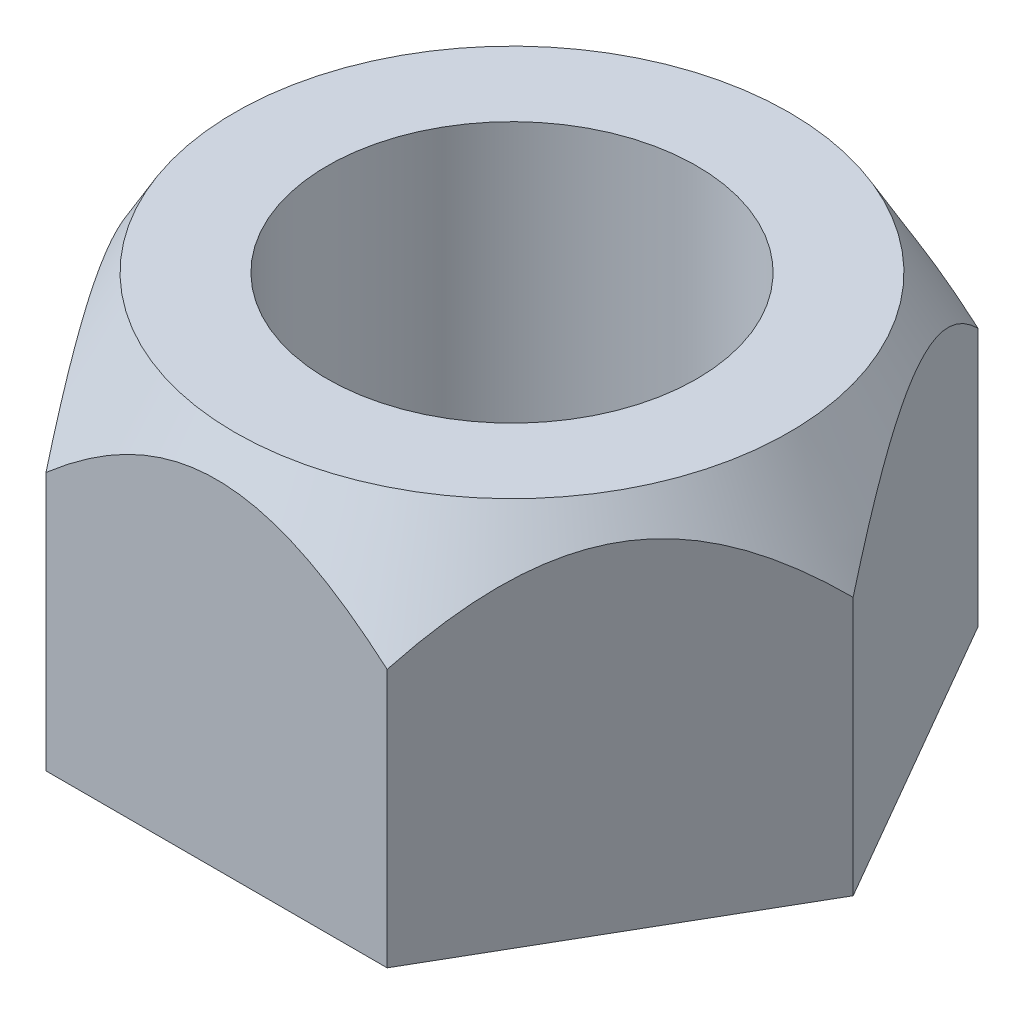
ISO-10303-21;
HEADER;
FILE_DESCRIPTION(('STEP AP214'),'2;1');
FILE_NAME('part.step','',(''),(''),'','','');
FILE_SCHEMA(('AUTOMOTIVE_DESIGN { 1 0 10303 214 1 1 1 1 }'));
ENDSEC;
DATA;
#1=APPLICATION_CONTEXT('core data for automotive mechanical design processes');
#2=APPLICATION_PROTOCOL_DEFINITION('international standard','automotive_design',2000,#1);
#3=PRODUCT_CONTEXT('',#1,'mechanical');
#4=PRODUCT('Part','Part','',(#3));
#5=PRODUCT_RELATED_PRODUCT_CATEGORY('part','',(#4));
#6=PRODUCT_DEFINITION_FORMATION('','',#4);
#7=PRODUCT_DEFINITION_CONTEXT('part definition',#1,'design');
#8=PRODUCT_DEFINITION('design','',#6,#7);
#9=PRODUCT_DEFINITION_SHAPE('','',#8);
#10=(LENGTH_UNIT() NAMED_UNIT(*) SI_UNIT(.MILLI.,.METRE.));
#11=(NAMED_UNIT(*) PLANE_ANGLE_UNIT() SI_UNIT($,.RADIAN.));
#12=(NAMED_UNIT(*) SI_UNIT($,.STERADIAN.) SOLID_ANGLE_UNIT());
#13=UNCERTAINTY_MEASURE_WITH_UNIT(LENGTH_MEASURE(1.E-05),#10,'distance_accuracy_value','');
#14=(GEOMETRIC_REPRESENTATION_CONTEXT(3) GLOBAL_UNCERTAINTY_ASSIGNED_CONTEXT((#13)) GLOBAL_UNIT_ASSIGNED_CONTEXT((#10,
#11,#12)) REPRESENTATION_CONTEXT('',''));
#15=CARTESIAN_POINT('',(0.,0.,0.));
#16=DIRECTION('',(0.,0.,1.));
#17=DIRECTION('',(1.,0.,0.));
#18=AXIS2_PLACEMENT_3D('',#15,#16,#17);
#19=CARTESIAN_POINT('',(-4.61880215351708,5.,0.));
#20=DIRECTION('',(0.866025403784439,0.,0.5));
#21=DIRECTION('',(0.5,0.,-0.866025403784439));
#22=AXIS2_PLACEMENT_3D('',#19,#20,#21);
#23=PLANE('',#22);
#24=CARTESIAN_POINT('',(-2.3094010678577,3.50000000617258,-3.9999999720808));
#25=CARTESIAN_POINT('',(-2.33355575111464,3.54183284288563,-3.95816286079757));
#26=CARTESIAN_POINT('',(-2.35795145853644,3.58310765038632,-3.91590826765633));
#27=CARTESIAN_POINT('',(-2.40727798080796,3.66438564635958,-3.83047223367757));
#28=CARTESIAN_POINT('',(-2.43220894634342,3.70438846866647,-3.78729053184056));
#29=CARTESIAN_POINT('',(-2.50812039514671,3.8226201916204,-3.65580804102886));
#30=CARTESIAN_POINT('',(-2.55997426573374,3.89864258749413,-3.56599450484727));
#31=CARTESIAN_POINT('',(-2.66771864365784,4.04477068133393,-3.37937576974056));
#32=CARTESIAN_POINT('',(-2.72367882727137,4.11467278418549,-3.28244988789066));
#33=CARTESIAN_POINT('',(-2.83863064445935,4.24333320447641,-3.08334749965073));
#34=CARTESIAN_POINT('',(-2.89761519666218,4.30211616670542,-2.9811832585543));
#35=CARTESIAN_POINT('',(-2.99110124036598,4.38153679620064,-2.81926068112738));
#36=CARTESIAN_POINT('',(-3.02450844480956,4.40734902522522,-2.76139770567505));
#37=CARTESIAN_POINT('',(-3.09219769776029,4.45396891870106,-2.64415648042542));
#38=CARTESIAN_POINT('',(-3.12647981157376,4.47477620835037,-2.58477811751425));
#39=CARTESIAN_POINT('',(-3.19550969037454,4.51059072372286,-2.46521486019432));
#40=CARTESIAN_POINT('',(-3.23025161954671,4.52564256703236,-2.40504007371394));
#41=CARTESIAN_POINT('',(-3.30025815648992,4.5496340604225,-2.28378519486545));
#42=CARTESIAN_POINT('',(-3.33552266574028,4.55857484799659,-2.22270527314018));
#43=CARTESIAN_POINT('',(-3.40664177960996,4.57004007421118,-2.09952335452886));
#44=CARTESIAN_POINT('',(-3.44249882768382,4.57250465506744,-2.0374171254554));
#45=CARTESIAN_POINT('',(-3.51417083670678,4.57073800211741,-1.91327756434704));
#46=CARTESIAN_POINT('',(-3.5499857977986,4.56650679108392,-1.85124423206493));
#47=CARTESIAN_POINT('',(-3.6213488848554,4.55151371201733,-1.7276397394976));
#48=CARTESIAN_POINT('',(-3.65689624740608,4.54073745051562,-1.66606990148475));
#49=CARTESIAN_POINT('',(-3.72740286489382,4.51307018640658,-1.54394885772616));
#50=CARTESIAN_POINT('',(-3.76236178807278,4.49617584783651,-1.4833982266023));
#51=CARTESIAN_POINT('',(-3.84146642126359,4.4511919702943,-1.34638498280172));
#52=CARTESIAN_POINT('',(-3.88535272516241,4.42127875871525,-1.27037167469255));
#53=CARTESIAN_POINT('',(-3.97162430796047,4.35369226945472,-1.12094491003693));
#54=CARTESIAN_POINT('',(-4.01400820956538,4.31601207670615,-1.04753383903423));
#55=CARTESIAN_POINT('',(-4.09736137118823,4.23412318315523,-0.903161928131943));
#56=CARTESIAN_POINT('',(-4.13832440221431,4.18988935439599,-0.832211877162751));
#57=CARTESIAN_POINT('',(-4.21870592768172,4.09622052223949,-0.692986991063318));
#58=CARTESIAN_POINT('',(-4.25812480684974,4.04678682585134,-0.624711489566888));
#59=CARTESIAN_POINT('',(-4.35354809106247,3.91973415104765,-0.459433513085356));
#60=CARTESIAN_POINT('',(-4.40874608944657,3.83969367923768,-0.363827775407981));
#61=CARTESIAN_POINT('',(-4.48926490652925,3.71509597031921,-0.224365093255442));
#62=CARTESIAN_POINT('',(-4.51558241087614,3.67305729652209,-0.178781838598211));
#63=CARTESIAN_POINT('',(-4.56762279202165,3.58755256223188,-0.0886452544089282));
#64=CARTESIAN_POINT('',(-4.59334579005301,3.5440867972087,-0.0440917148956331));
#65=CARTESIAN_POINT('',(-4.61880212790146,3.50000004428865,-4.43674786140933E-08));
#66=B_SPLINE_CURVE_WITH_KNOTS('',3,(#24,#25,#26,#27,#28,#29,#30,#31,#32,#33,#34,#35,#36,#37,#38,
#39,#40,#41,#42,#43,#44,#45,#46,#47,#48,#49,#50,#51,#52,#53,#54,#55,#56,#57,#58,#59,#60,#61,#62,
#63,#64,#65),.UNSPECIFIED.,.F.,.F.,(4,2,2,2,2,2,2,2,2,2,2,2,2,2,2,2,2,2,2,2,4),(0.,
0.191704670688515,0.383464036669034,0.76893622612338,1.16436694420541,1.55891067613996,
1.77362931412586,1.98836402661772,2.20139858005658,2.41439346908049,2.6293501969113,
2.84430619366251,3.0597366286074,3.27528470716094,3.55302006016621,3.83100376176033,
4.11008229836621,4.38909085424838,4.79777343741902,4.99984380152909,5.20187258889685),.UNSPECIFIED.);
#67=CARTESIAN_POINT('',(-2.30940105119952,3.50000002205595,-4.00000000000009));
#68=VERTEX_POINT('',#67);
#69=CARTESIAN_POINT('',(-4.61880214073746,3.50000002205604,-2.21349330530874E-08));
#70=VERTEX_POINT('',#69);
#71=EDGE_CURVE('E170',#68,#70,#66,.T.);
#72=ORIENTED_EDGE('',*,*,#71,.F.);
#73=DIRECTION('',(0.,1.,0.));
#74=VECTOR('',#73,1.);
#75=CARTESIAN_POINT('',(-2.30940107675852,4.99999999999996,-4.00000000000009));
#76=LINE('',#75,#74);
#77=CARTESIAN_POINT('',(-2.30940107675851,0.,-4.00000000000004));
#78=VERTEX_POINT('',#77);
#79=EDGE_CURVE('E116',#68,#78,#76,.F.);
#80=ORIENTED_EDGE('',*,*,#79,.T.);
#81=DIRECTION('',(0.500000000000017,0.,-0.866025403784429));
#82=VECTOR('',#81,1.);
#83=CARTESIAN_POINT('',(-4.6188021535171,0.,0.));
#84=LINE('',#83,#82);
#85=CARTESIAN_POINT('',(-4.61880215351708,0.,0.));
#86=VERTEX_POINT('',#85);
#87=EDGE_CURVE('E88',#86,#78,#84,.T.);
#88=ORIENTED_EDGE('',*,*,#87,.F.);
#89=DIRECTION('',(0.,1.,0.));
#90=VECTOR('',#89,1.);
#91=CARTESIAN_POINT('',(-4.61880215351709,5.,0.));
#92=LINE('',#91,#90);
#93=EDGE_CURVE('E93',#86,#70,#92,.T.);
#94=ORIENTED_EDGE('',*,*,#93,.T.);
#95=EDGE_LOOP('',(#72,#80,#88,#94));
#96=FACE_BOUND('',#95,.T.);
#97=ADVANCED_FACE('F17',(#96),#23,.F.);
#98=CARTESIAN_POINT('',(-2.3094010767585,4.99999999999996,-4.00000000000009));
#99=DIRECTION('',(0.,0.,1.));
#100=DIRECTION('',(1.,0.,0.));
#101=AXIS2_PLACEMENT_3D('',#98,#99,#100);
#102=PLANE('',#101);
#103=CARTESIAN_POINT('',(2.30940105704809,3.50000000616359,-3.99999997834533));
#104=CARTESIAN_POINT('',(2.26107743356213,3.54184559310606,-3.99999999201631));
#105=CARTESIAN_POINT('',(2.21227057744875,3.58313298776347,-3.99999999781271));
#106=CARTESIAN_POINT('',(2.11358751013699,3.66443403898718,-4.00000000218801));
#107=CARTESIAN_POINT('',(2.06371103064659,3.70444736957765,-4.00000000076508));
#108=CARTESIAN_POINT('',(1.91184114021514,3.82271256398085,-3.99999999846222));
#109=CARTESIAN_POINT('',(1.80810235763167,3.89875572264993,-3.99999999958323));
#110=CARTESIAN_POINT('',(1.59259120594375,4.04487907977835,-4.00000000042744));
#111=CARTESIAN_POINT('',(1.480682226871,4.1147605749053,-4.00000000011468));
#112=CARTESIAN_POINT('',(1.25089013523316,4.24336581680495,-3.99999999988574));
#113=CARTESIAN_POINT('',(1.13302122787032,4.30211464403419,-3.99999999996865));
#114=CARTESIAN_POINT('',(0.87704738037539,4.41080511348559,-4.00000000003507));
#115=CARTESIAN_POINT('',(0.738162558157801,4.45899546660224,-4.00000000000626));
#116=CARTESIAN_POINT('',(0.52588947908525,4.51322297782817,-3.99999999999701));
#117=CARTESIAN_POINT('',(0.454752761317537,4.52826570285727,-3.99999999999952));
#118=CARTESIAN_POINT('',(0.311435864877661,4.55192341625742,-4.00000000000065));
#119=CARTESIAN_POINT('',(0.239256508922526,4.56054321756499,-3.99999999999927));
#120=CARTESIAN_POINT('',(0.13910392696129,4.56777578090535,-4.00000000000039));
#121=CARTESIAN_POINT('',(0.111317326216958,4.5692816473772,-4.00000000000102));
#122=CARTESIAN_POINT('',(0.0556886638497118,4.57129293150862,-3.99999999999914));
#123=CARTESIAN_POINT('',(0.0278465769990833,4.57179764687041,-3.99999999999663));
#124=CARTESIAN_POINT('',(-0.0782746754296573,4.57179430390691,-3.99999999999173));
#125=CARTESIAN_POINT('',(-0.156584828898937,4.56779699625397,-3.99999999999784));
#126=CARTESIAN_POINT('',(-0.312449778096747,4.55200198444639,-4.00000000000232));
#127=CARTESIAN_POINT('',(-0.390003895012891,4.54019782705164,-4.00000000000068));
#128=CARTESIAN_POINT('',(-0.543886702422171,4.50930201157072,-3.99999999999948));
#129=CARTESIAN_POINT('',(-0.62021080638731,4.49018769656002,-3.99999999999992));
#130=CARTESIAN_POINT('',(-0.770962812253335,4.44545692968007,-4.00000000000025));
#131=CARTESIAN_POINT('',(-0.845389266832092,4.41983566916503,-4.00000000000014));
#132=CARTESIAN_POINT('',(-1.02282883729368,4.35103871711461,-4.00000000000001));
#133=CARTESIAN_POINT('',(-1.12473374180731,4.30500809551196,-4.00000000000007));
#134=CARTESIAN_POINT('',(-1.3239589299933,4.2040192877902,-4.0000000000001));
#135=CARTESIAN_POINT('',(-1.42127809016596,4.14905892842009,-4.00000000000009));
#136=CARTESIAN_POINT('',(-1.61176859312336,4.03209777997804,-4.00000000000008));
#137=CARTESIAN_POINT('',(-1.70493275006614,3.97008540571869,-4.00000000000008));
#138=CARTESIAN_POINT('',(-1.88734918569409,3.84065955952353,-4.00000000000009));
#139=CARTESIAN_POINT('',(-1.9766028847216,3.77324807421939,-4.00000000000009));
#140=CARTESIAN_POINT('',(-2.1058363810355,3.67059804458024,-4.00000000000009));
#141=CARTESIAN_POINT('',(-2.14713768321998,3.63700271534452,-4.00000000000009));
#142=CARTESIAN_POINT('',(-2.22886898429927,3.56906481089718,-4.00000000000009));
#143=CARTESIAN_POINT('',(-2.26930159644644,3.53472538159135,-4.00000000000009));
#144=CARTESIAN_POINT('',(-2.30940102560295,3.50000004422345,-4.00000000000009));
#145=B_SPLINE_CURVE_WITH_KNOTS('',3,(#103,#104,#105,#106,#107,#108,#109,#110,#111,#112,#113,
#114,#115,#116,#117,#118,#119,#120,#121,#122,#123,#124,#125,#126,#127,#128,#129,#130,#131,#132,
#133,#134,#135,#136,#137,#138,#139,#140,#141,#142,#143,#144),.UNSPECIFIED.,.F.,.F.,(4,2,2,2,2,2,
2,2,2,2,2,2,2,2,2,2,2,2,2,2,4),(0.,0.191763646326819,0.383575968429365,0.769172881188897,
1.16449259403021,1.55891082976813,1.99800386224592,2.21589518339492,2.43362306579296,
2.51709092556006,2.60061731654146,2.83540384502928,3.07038469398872,3.30609981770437,
3.54198964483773,3.87685426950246,4.21180051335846,4.54730518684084,4.88268697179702,
5.04239619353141,5.20152716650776),.UNSPECIFIED.);
#146=CARTESIAN_POINT('',(2.30940108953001,3.50000002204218,-3.99999997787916));
#147=VERTEX_POINT('',#146);
#148=EDGE_CURVE('E98',#147,#68,#145,.T.);
#149=ORIENTED_EDGE('',*,*,#148,.F.);
#150=DIRECTION('',(0.,1.,0.));
#151=VECTOR('',#150,1.);
#152=CARTESIAN_POINT('',(2.30940107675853,5.00000000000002,-4.));
#153=LINE('',#152,#151);
#154=CARTESIAN_POINT('',(2.30940107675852,0.,-4.00000000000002));
#155=VERTEX_POINT('',#154);
#156=EDGE_CURVE('E111',#147,#155,#153,.F.);
#157=ORIENTED_EDGE('',*,*,#156,.T.);
#158=DIRECTION('',(1.,0.,0.));
#159=VECTOR('',#158,1.);
#160=CARTESIAN_POINT('',(-2.3094010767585,0.,-4.));
#161=LINE('',#160,#159);
#162=EDGE_CURVE('E133',#78,#155,#161,.T.);
#163=ORIENTED_EDGE('',*,*,#162,.F.);
#164=ORIENTED_EDGE('',*,*,#79,.F.);
#165=EDGE_LOOP('',(#149,#157,#163,#164));
#166=FACE_BOUND('',#165,.T.);
#167=ADVANCED_FACE('F188',(#166),#102,.F.);
#168=CARTESIAN_POINT('',(2.30940107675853,5.00000000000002,-4.));
#169=DIRECTION('',(-0.866025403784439,0.,0.499999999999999));
#170=DIRECTION('',(0.499999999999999,0.,0.866025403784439));
#171=AXIS2_PLACEMENT_3D('',#168,#169,#170);
#172=PLANE('',#171);
#173=CARTESIAN_POINT('',(4.61880212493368,3.50000000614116,-6.21994635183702E-09));
#174=CARTESIAN_POINT('',(4.59464746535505,3.54183284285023,-0.0418371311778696));
#175=CARTESIAN_POINT('',(4.57025176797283,3.5831076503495,-0.0840917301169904));
#176=CARTESIAN_POINT('',(4.52092525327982,3.66438564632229,-0.169527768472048));
#177=CARTESIAN_POINT('',(4.49599428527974,3.70438846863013,-0.212709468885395));
#178=CARTESIAN_POINT('',(4.42008283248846,3.82262019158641,-0.344191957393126));
#179=CARTESIAN_POINT('',(4.36822896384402,3.89864258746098,-0.434005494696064));
#180=CARTESIAN_POINT('',(4.26048458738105,4.04477068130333,-0.620624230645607));
#181=CARTESIAN_POINT('',(4.20452440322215,4.11467278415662,-0.71755011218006));
#182=CARTESIAN_POINT('',(4.08957258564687,4.24333320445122,-0.916652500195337));
#183=CARTESIAN_POINT('',(4.03058803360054,4.30211616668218,-1.01881674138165));
#184=CARTESIAN_POINT('',(3.93710198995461,4.38153679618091,-1.18073931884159));
#185=CARTESIAN_POINT('',(3.9036947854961,4.40734902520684,-1.23860229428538));
#186=CARTESIAN_POINT('',(3.83600553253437,4.45396891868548,-1.35584351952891));
#187=CARTESIAN_POINT('',(3.80172341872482,4.47477620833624,-1.41522188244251));
#188=CARTESIAN_POINT('',(3.73269353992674,4.51059072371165,-1.53478513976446));
#189=CARTESIAN_POINT('',(3.69795161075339,4.52564256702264,-1.59495992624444));
#190=CARTESIAN_POINT('',(3.6279450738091,4.54963406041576,-1.71621480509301));
#191=CARTESIAN_POINT('',(3.59268056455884,4.55857484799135,-1.77729472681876));
#192=CARTESIAN_POINT('',(3.5215614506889,4.5700400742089,-1.90047664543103));
#193=CARTESIAN_POINT('',(3.48570440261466,4.57250465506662,-1.96258287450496));
#194=CARTESIAN_POINT('',(3.41403239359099,4.57073800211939,-2.08672243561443));
#195=CARTESIAN_POINT('',(3.37821743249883,4.56650679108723,-2.14875576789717));
#196=CARTESIAN_POINT('',(3.30685434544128,4.55151371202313,-2.27236026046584));
#197=CARTESIAN_POINT('',(3.27130698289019,4.54073745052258,-2.33393009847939));
#198=CARTESIAN_POINT('',(3.2008003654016,4.51307018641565,-2.45605114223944));
#199=CARTESIAN_POINT('',(3.1658414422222,4.49617584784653,-2.51660177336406));
#200=CARTESIAN_POINT('',(3.08673680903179,4.45119197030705,-2.65361501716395));
#201=CARTESIAN_POINT('',(3.04285050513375,4.42127875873,-2.72962832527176));
#202=CARTESIAN_POINT('',(2.95657892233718,4.3536922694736,-2.87905508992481));
#203=CARTESIAN_POINT('',(2.91419502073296,4.31601207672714,-2.95246616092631));
#204=CARTESIAN_POINT('',(2.83084185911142,4.2341231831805,-3.09683807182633));
#205=CARTESIAN_POINT('',(2.78987882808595,4.18988935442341,-3.16778812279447));
#206=CARTESIAN_POINT('',(2.70949730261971,4.09622052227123,-3.30701300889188));
#207=CARTESIAN_POINT('',(2.67007842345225,4.04678682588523,-3.37528851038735));
#208=CARTESIAN_POINT('',(2.57465513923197,3.91973415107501,-3.54056648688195));
#209=CARTESIAN_POINT('',(2.51945714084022,3.83969367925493,-3.63617222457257));
#210=CARTESIAN_POINT('',(2.4389383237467,3.71509597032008,-3.77563490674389));
#211=CARTESIAN_POINT('',(2.41262081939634,3.67305729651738,-3.82121816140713));
#212=CARTESIAN_POINT('',(2.36058043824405,3.58755256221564,-3.91135474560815));
#213=CARTESIAN_POINT('',(2.33485744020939,3.54408679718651,-3.95590828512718));
#214=CARTESIAN_POINT('',(2.30940110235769,3.50000004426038,-3.99999995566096));
#215=B_SPLINE_CURVE_WITH_KNOTS('',3,(#173,#174,#175,#176,#177,#178,#179,#180,#181,#182,#183,
#184,#185,#186,#187,#188,#189,#190,#191,#192,#193,#194,#195,#196,#197,#198,#199,#200,#201,#202,
#203,#204,#205,#206,#207,#208,#209,#210,#211,#212,#213,#214),.UNSPECIFIED.,.F.,.F.,(4,2,2,2,2,2,
2,2,2,2,2,2,2,2,2,2,2,2,2,2,4),(0.,0.191704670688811,0.383464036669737,0.768936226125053,
1.16436694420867,1.55891067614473,1.7736293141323,1.98836402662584,2.20139858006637,
2.41439346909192,2.62935019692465,2.84430619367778,3.05973662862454,3.27528470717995,
3.55302006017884,3.83100376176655,4.11008229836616,4.38909085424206,4.79777343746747,
4.99984380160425,5.20187258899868),.UNSPECIFIED.);
#216=CARTESIAN_POINT('',(4.61880214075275,3.50000002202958,2.210856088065E-08));
#217=VERTEX_POINT('',#216);
#218=EDGE_CURVE('E96',#217,#147,#215,.T.);
#219=ORIENTED_EDGE('',*,*,#218,.F.);
#220=DIRECTION('',(0.,1.,0.));
#221=VECTOR('',#220,1.);
#222=CARTESIAN_POINT('',(4.61880215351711,5.,0.));
#223=LINE('',#222,#221);
#224=CARTESIAN_POINT('',(4.6188021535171,0.,0.));
#225=VERTEX_POINT('',#224);
#226=EDGE_CURVE('E74',#217,#225,#223,.F.);
#227=ORIENTED_EDGE('',*,*,#226,.T.);
#228=DIRECTION('',(0.500000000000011,0.,0.866025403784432));
#229=VECTOR('',#228,1.);
#230=CARTESIAN_POINT('',(2.30940107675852,0.,-4.));
#231=LINE('',#230,#229);
#232=EDGE_CURVE('E137',#155,#225,#231,.T.);
#233=ORIENTED_EDGE('',*,*,#232,.F.);
#234=ORIENTED_EDGE('',*,*,#156,.F.);
#235=EDGE_LOOP('',(#219,#227,#233,#234));
#236=FACE_BOUND('',#235,.T.);
#237=ADVANCED_FACE('F185',(#236),#172,.F.);
#238=CARTESIAN_POINT('',(4.61880215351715,5.,0.));
#239=DIRECTION('',(-0.866025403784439,0.,-0.499999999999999));
#240=DIRECTION('',(-0.499999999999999,0.,0.866025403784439));
#241=AXIS2_PLACEMENT_3D('',#238,#239,#240);
#242=PLANE('',#241);
#243=CARTESIAN_POINT('',(2.30940106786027,3.500000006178,3.99999997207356));
#244=CARTESIAN_POINT('',(2.33355575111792,3.54183284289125,3.95816286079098));
#245=CARTESIAN_POINT('',(2.35795145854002,3.58310765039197,3.91590826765));
#246=CARTESIAN_POINT('',(2.4072779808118,3.66438564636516,3.8304722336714));
#247=CARTESIAN_POINT('',(2.4322089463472,3.70438846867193,3.7872905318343));
#248=CARTESIAN_POINT('',(2.50812039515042,3.82262019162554,3.65580804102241));
#249=CARTESIAN_POINT('',(2.55997426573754,3.8986425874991,3.56599450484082));
#250=CARTESIAN_POINT('',(2.66771864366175,4.04477068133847,3.37937576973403));
#251=CARTESIAN_POINT('',(2.7236788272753,4.11467278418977,3.28244988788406));
#252=CARTESIAN_POINT('',(2.83863064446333,4.24333320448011,3.08334749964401));
#253=CARTESIAN_POINT('',(2.8976151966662,4.3021161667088,2.98118325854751));
#254=CARTESIAN_POINT('',(2.99110124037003,4.38153679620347,2.81926068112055));
#255=CARTESIAN_POINT('',(3.02450844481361,4.40734902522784,2.76139770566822));
#256=CARTESIAN_POINT('',(3.09219769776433,4.45396891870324,2.64415648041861));
#257=CARTESIAN_POINT('',(3.12647981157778,4.47477620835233,2.58477811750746));
#258=CARTESIAN_POINT('',(3.19550969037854,4.51059072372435,2.46521486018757));
#259=CARTESIAN_POINT('',(3.23025161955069,4.52564256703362,2.40504007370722));
#260=CARTESIAN_POINT('',(3.30025815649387,4.54963406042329,2.28378519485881));
#261=CARTESIAN_POINT('',(3.3355226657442,4.55857484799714,2.22270527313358));
#262=CARTESIAN_POINT('',(3.4066417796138,4.57004007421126,2.09952335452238));
#263=CARTESIAN_POINT('',(3.44249882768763,4.57250465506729,2.037417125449));
#264=CARTESIAN_POINT('',(3.51417083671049,4.57073800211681,1.9132775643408));
#265=CARTESIAN_POINT('',(3.54998579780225,4.56650679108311,1.85124423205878));
#266=CARTESIAN_POINT('',(3.62134888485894,4.55151371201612,1.72763973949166));
#267=CARTESIAN_POINT('',(3.65689624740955,4.54073745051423,1.66606990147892));
#268=CARTESIAN_POINT('',(3.72740286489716,4.51307018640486,1.54394885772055));
#269=CARTESIAN_POINT('',(3.76236178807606,4.49617584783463,1.4833982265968));
#270=CARTESIAN_POINT('',(3.84146642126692,4.45119197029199,1.34638498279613));
#271=CARTESIAN_POINT('',(3.88535272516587,4.42127875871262,1.27037167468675));
#272=CARTESIAN_POINT('',(3.97162430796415,4.35369226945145,1.12094491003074));
#273=CARTESIAN_POINT('',(4.01400820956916,4.31601207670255,1.04753383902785));
#274=CARTESIAN_POINT('',(4.09736137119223,4.23412318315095,0.903161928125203));
#275=CARTESIAN_POINT('',(4.13832440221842,4.18988935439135,0.832211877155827));
#276=CARTESIAN_POINT('',(4.21870592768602,4.09622052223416,0.692986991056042));
#277=CARTESIAN_POINT('',(4.25812480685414,4.04678682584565,0.624711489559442));
#278=CARTESIAN_POINT('',(4.35354809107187,3.91973415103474,0.459433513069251));
#279=CARTESIAN_POINT('',(4.40874608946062,3.83969367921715,0.363827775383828));
#280=CARTESIAN_POINT('',(4.4892649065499,3.71509597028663,0.22436509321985));
#281=CARTESIAN_POINT('',(4.51558241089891,3.67305729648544,0.178781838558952));
#282=CARTESIAN_POINT('',(4.56762279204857,3.58755256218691,0.088645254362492));
#283=CARTESIAN_POINT('',(4.59334579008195,3.54408679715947,0.044091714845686));
#284=CARTESIAN_POINT('',(4.61880212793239,3.5000000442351,4.43140840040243E-08));
#285=B_SPLINE_CURVE_WITH_KNOTS('',3,(#243,#244,#245,#246,#247,#248,#249,#250,#251,#252,#253,
#254,#255,#256,#257,#258,#259,#260,#261,#262,#263,#264,#265,#266,#267,#268,#269,#270,#271,#272,
#273,#274,#275,#276,#277,#278,#279,#280,#281,#282,#283,#284),.UNSPECIFIED.,.F.,.F.,(4,2,2,2,2,2,
2,2,2,2,2,2,2,2,2,2,2,2,2,2,4),(0.,0.191704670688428,0.383464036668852,0.76893622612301,
1.1643669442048,1.5589106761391,1.77362931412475,1.98836402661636,2.20139858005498,
2.41439346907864,2.62935019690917,2.8443061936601,3.0597366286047,3.27528470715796,
3.55302006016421,3.83100376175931,4.11008229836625,4.38909085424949,4.79777343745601,
4.99984380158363,5.20187258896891),.UNSPECIFIED.);
#286=CARTESIAN_POINT('',(2.30940105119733,3.50000002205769,4.00000000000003));
#287=VERTEX_POINT('',#286);
#288=EDGE_CURVE('E21',#287,#217,#285,.T.);
#289=ORIENTED_EDGE('',*,*,#288,.F.);
#290=DIRECTION('',(0.,1.,0.));
#291=VECTOR('',#290,1.);
#292=CARTESIAN_POINT('',(2.30940107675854,5.00000000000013,4.00000000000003));
#293=LINE('',#292,#291);
#294=CARTESIAN_POINT('',(2.30940107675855,0.,4.00000000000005));
#295=VERTEX_POINT('',#294);
#296=EDGE_CURVE('E91',#287,#295,#293,.F.);
#297=ORIENTED_EDGE('',*,*,#296,.T.);
#298=DIRECTION('',(-0.500000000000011,0.,0.866025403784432));
#299=VECTOR('',#298,1.);
#300=CARTESIAN_POINT('',(4.61880215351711,0.,0.));
#301=LINE('',#300,#299);
#302=EDGE_CURVE('E125',#225,#295,#301,.T.);
#303=ORIENTED_EDGE('',*,*,#302,.F.);
#304=ORIENTED_EDGE('',*,*,#226,.F.);
#305=EDGE_LOOP('',(#289,#297,#303,#304));
#306=FACE_BOUND('',#305,.T.);
#307=ADVANCED_FACE('F95',(#306),#242,.F.);
#308=CARTESIAN_POINT('',(2.30940107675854,5.00000000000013,4.00000000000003));
#309=DIRECTION('',(0.,0.,-1.));
#310=DIRECTION('',(-1.,0.,0.));
#311=AXIS2_PLACEMENT_3D('',#308,#309,#310);
#312=PLANE('',#311);
#313=ORIENTED_EDGE('',*,*,#296,.F.);
#314=CARTESIAN_POINT('',(-2.30940105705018,3.50000000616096,3.99999997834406));
#315=CARTESIAN_POINT('',(-2.2610774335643,3.54184559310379,3.99999999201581));
#316=CARTESIAN_POINT('',(-2.21227057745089,3.58313298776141,3.99999999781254));
#317=CARTESIAN_POINT('',(-2.11358751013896,3.66443403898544,4.00000000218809));
#318=CARTESIAN_POINT('',(-2.06371103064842,3.70444736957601,4.00000000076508));
#319=CARTESIAN_POINT('',(-1.91184114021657,3.82271256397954,3.99999999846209));
#320=CARTESIAN_POINT('',(-1.80810235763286,3.89875572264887,3.99999999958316));
#321=CARTESIAN_POINT('',(-1.59259120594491,4.0448790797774,4.00000000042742));
#322=CARTESIAN_POINT('',(-1.48068222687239,4.11476057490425,4.00000000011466));
#323=CARTESIAN_POINT('',(-1.25089013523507,4.24336581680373,3.99999999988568));
#324=CARTESIAN_POINT('',(-1.13302122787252,4.30211464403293,3.99999999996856));
#325=CARTESIAN_POINT('',(-0.877047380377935,4.41080511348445,4.00000000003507));
#326=CARTESIAN_POINT('',(-0.738162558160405,4.45899546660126,4.0000000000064));
#327=CARTESIAN_POINT('',(-0.525889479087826,4.51322297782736,3.99999999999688));
#328=CARTESIAN_POINT('',(-0.454752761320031,4.52826570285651,3.99999999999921));
#329=CARTESIAN_POINT('',(-0.311435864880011,4.55192341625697,4.00000000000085));
#330=CARTESIAN_POINT('',(-0.239256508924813,4.56054321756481,4.00000000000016));
#331=CARTESIAN_POINT('',(-0.139103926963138,4.56777578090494,3.99999999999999));
#332=CARTESIAN_POINT('',(-0.111317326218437,4.56928164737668,4.00000000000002));
#333=CARTESIAN_POINT('',(-0.0556886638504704,4.57129293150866,4.00000000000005));
#334=CARTESIAN_POINT('',(-0.0278465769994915,4.57179764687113,4.00000000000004));
#335=CARTESIAN_POINT('',(0.0782746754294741,4.57179430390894,4.00000000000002));
#336=CARTESIAN_POINT('',(0.156584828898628,4.56779699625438,4.00000000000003));
#337=CARTESIAN_POINT('',(0.312449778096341,4.55200198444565,4.00000000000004));
#338=CARTESIAN_POINT('',(0.390003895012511,4.54019782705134,4.00000000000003));
#339=CARTESIAN_POINT('',(0.543886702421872,4.50930201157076,4.00000000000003));
#340=CARTESIAN_POINT('',(0.620210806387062,4.49018769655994,4.00000000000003));
#341=CARTESIAN_POINT('',(0.770962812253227,4.44545692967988,4.00000000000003));
#342=CARTESIAN_POINT('',(0.845389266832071,4.41983566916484,4.00000000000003));
#343=CARTESIAN_POINT('',(1.02282883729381,4.35103871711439,4.00000000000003));
#344=CARTESIAN_POINT('',(1.1247337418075,4.3050080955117,4.00000000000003));
#345=CARTESIAN_POINT('',(1.32395892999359,4.20401928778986,4.00000000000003));
#346=CARTESIAN_POINT('',(1.42127809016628,4.14905892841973,4.00000000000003));
#347=CARTESIAN_POINT('',(1.61176859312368,4.03209777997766,4.00000000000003));
#348=CARTESIAN_POINT('',(1.70493275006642,3.97008540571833,4.00000000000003));
#349=CARTESIAN_POINT('',(1.88734918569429,3.84065955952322,4.00000000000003));
#350=CARTESIAN_POINT('',(1.97660288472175,3.77324807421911,4.00000000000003));
#351=CARTESIAN_POINT('',(2.10583638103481,3.67059804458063,4.00000000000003));
#352=CARTESIAN_POINT('',(2.14713768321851,3.63700271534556,4.00000000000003));
#353=CARTESIAN_POINT('',(2.22886898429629,3.56906481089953,4.00000000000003));
#354=CARTESIAN_POINT('',(2.26930159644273,3.53472538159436,4.00000000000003));
#355=CARTESIAN_POINT('',(2.30940102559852,3.50000004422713,4.00000000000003));
#356=B_SPLINE_CURVE_WITH_KNOTS('',3,(#314,#315,#316,#317,#318,#319,#320,#321,#322,#323,#324,
#325,#326,#327,#328,#329,#330,#331,#332,#333,#334,#335,#336,#337,#338,#339,#340,#341,#342,#343,
#344,#345,#346,#347,#348,#349,#350,#351,#352,#353,#354,#355),.UNSPECIFIED.,.F.,.F.,(4,2,2,2,2,2,
2,2,2,2,2,2,2,2,2,2,2,2,2,2,4),(0.,0.191763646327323,0.383575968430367,0.769172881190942,
1.16449259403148,1.55891082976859,1.99800386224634,2.21589518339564,2.43362306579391,
2.51709092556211,2.60061731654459,2.83540384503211,3.07038469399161,3.30609981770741,
3.54198964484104,3.87685426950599,4.21180051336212,4.54730518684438,4.88268697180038,
5.04239619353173,5.20152716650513),.UNSPECIFIED.);
#357=CARTESIAN_POINT('',(-2.3094010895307,3.50000002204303,3.99999997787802));
#358=VERTEX_POINT('',#357);
#359=EDGE_CURVE('E80',#358,#287,#356,.T.);
#360=ORIENTED_EDGE('',*,*,#359,.F.);
#361=DIRECTION('',(0.,1.,0.));
#362=VECTOR('',#361,1.);
#363=CARTESIAN_POINT('',(-2.30940107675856,5.,4.00000000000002));
#364=LINE('',#363,#362);
#365=CARTESIAN_POINT('',(-2.30940107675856,1.2490009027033E-13,4.00000000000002));
#366=VERTEX_POINT('',#365);
#367=EDGE_CURVE('E97',#358,#366,#364,.F.);
#368=ORIENTED_EDGE('',*,*,#367,.T.);
#369=DIRECTION('',(1.,0.,0.));
#370=VECTOR('',#369,1.);
#371=CARTESIAN_POINT('',(-2.3094010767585,0.,4.00000000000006));
#372=LINE('',#371,#370);
#373=EDGE_CURVE('E41',#295,#366,#372,.F.);
#374=ORIENTED_EDGE('',*,*,#373,.F.);
#375=EDGE_LOOP('',(#313,#360,#368,#374));
#376=FACE_BOUND('',#375,.T.);
#377=ADVANCED_FACE('F92',(#376),#312,.F.);
#378=CARTESIAN_POINT('',(-2.30940107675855,5.,4.00000000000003));
#379=DIRECTION('',(0.866025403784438,0.,-0.500000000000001));
#380=DIRECTION('',(-0.500000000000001,0.,-0.866025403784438));
#381=AXIS2_PLACEMENT_3D('',#378,#379,#380);
#382=PLANE('',#381);
#383=CARTESIAN_POINT('',(-4.61880212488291,3.50000000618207,6.26097516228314E-09));
#384=CARTESIAN_POINT('',(-4.59464746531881,3.5418328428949,0.0418371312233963));
#385=CARTESIAN_POINT('',(-4.57025176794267,3.58310765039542,0.0840917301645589));
#386=CARTESIAN_POINT('',(-4.5209252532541,3.66438564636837,0.169527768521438));
#387=CARTESIAN_POINT('',(-4.49599428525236,3.70438846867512,0.212709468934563));
#388=CARTESIAN_POINT('',(-4.42008283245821,3.82262019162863,0.344191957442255));
#389=CARTESIAN_POINT('',(-4.36822896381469,3.89864258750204,0.434005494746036));
#390=CARTESIAN_POINT('',(-4.2604845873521,4.04477068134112,0.620624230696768));
#391=CARTESIAN_POINT('',(-4.20452440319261,4.11467278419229,0.717550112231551));
#392=CARTESIAN_POINT('',(-4.08957258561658,4.24333320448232,0.916652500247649));
#393=CARTESIAN_POINT('',(-4.03058803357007,4.30211616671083,1.01881674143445));
#394=CARTESIAN_POINT('',(-3.93710198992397,4.38153679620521,1.18073931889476));
#395=CARTESIAN_POINT('',(-3.90369478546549,4.40734902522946,1.23860229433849));
#396=CARTESIAN_POINT('',(-3.83600553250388,4.45396891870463,1.3558435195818));
#397=CARTESIAN_POINT('',(-3.80172341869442,4.4747762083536,1.41522188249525));
#398=CARTESIAN_POINT('',(-3.73269353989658,4.51059072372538,1.53478513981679));
#399=CARTESIAN_POINT('',(-3.69795161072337,4.52564256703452,1.59495992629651));
#400=CARTESIAN_POINT('',(-3.62794507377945,4.54963406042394,1.71621480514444));
#401=CARTESIAN_POINT('',(-3.59268056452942,4.55857484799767,1.77729472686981));
#402=CARTESIAN_POINT('',(-3.52156145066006,4.57004007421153,1.90047664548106));
#403=CARTESIAN_POINT('',(-3.48570440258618,4.57250465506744,1.96258287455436));
#404=CARTESIAN_POINT('',(-3.41403239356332,4.57073800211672,2.08672243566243));
#405=CARTESIAN_POINT('',(-3.3782174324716,4.56650679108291,2.14875576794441));
#406=CARTESIAN_POINT('',(-3.30685434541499,4.55151371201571,2.27236026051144));
#407=CARTESIAN_POINT('',(-3.2713069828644,4.54073745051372,2.33393009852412));
#408=CARTESIAN_POINT('',(-3.20080036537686,4.51307018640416,2.45605114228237));
#409=CARTESIAN_POINT('',(-3.16584144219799,4.49617584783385,2.51660177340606));
#410=CARTESIAN_POINT('',(-3.08673680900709,4.45119197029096,2.65361501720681));
#411=CARTESIAN_POINT('',(-3.04285050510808,4.42127875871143,2.72962832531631));
#412=CARTESIAN_POINT('',(-2.95657892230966,4.35369226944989,2.87905508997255));
#413=CARTESIAN_POINT('',(-2.91419502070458,4.3160120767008,2.95246616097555));
#414=CARTESIAN_POINT('',(-2.8308418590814,4.23412318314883,3.09683807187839));
#415=CARTESIAN_POINT('',(-2.78987882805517,4.18988935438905,3.16778812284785));
#416=CARTESIAN_POINT('',(-2.70949730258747,4.09622052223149,3.30701300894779));
#417=CARTESIAN_POINT('',(-2.67007842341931,4.04678682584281,3.37528851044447));
#418=CARTESIAN_POINT('',(-2.57465513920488,3.91973415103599,3.54056648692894));
#419=CARTESIAN_POINT('',(-2.5194571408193,3.83969367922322,3.63617222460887));
#420=CARTESIAN_POINT('',(-2.43893832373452,3.71509597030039,3.77563490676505));
#421=CARTESIAN_POINT('',(-2.41262081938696,3.67305729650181,3.82121816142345));
#422=CARTESIAN_POINT('',(-2.36058043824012,3.58755256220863,3.91135474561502));
#423=CARTESIAN_POINT('',(-2.33485744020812,3.54408679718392,3.95590828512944));
#424=CARTESIAN_POINT('',(-2.30940110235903,3.50000004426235,3.9999999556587));
#425=B_SPLINE_CURVE_WITH_KNOTS('',3,(#383,#384,#385,#386,#387,#388,#389,#390,#391,#392,#393,
#394,#395,#396,#397,#398,#399,#400,#401,#402,#403,#404,#405,#406,#407,#408,#409,#410,#411,#412,
#413,#414,#415,#416,#417,#418,#419,#420,#421,#422,#423,#424),.UNSPECIFIED.,.F.,.F.,(4,2,2,2,2,2,
2,2,2,2,2,2,2,2,2,2,2,2,2,2,4),(0.,0.191704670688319,0.383464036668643,0.768936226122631,
1.16436694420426,1.5589106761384,1.77362931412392,1.9883640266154,2.20139858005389,
2.41439346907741,2.62935019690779,2.84430619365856,3.05973662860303,3.27528470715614,
3.55302006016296,3.83100376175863,4.11008229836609,4.38909085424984,4.79777343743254,
4.99984380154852,5.20187258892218),.UNSPECIFIED.);
#426=EDGE_CURVE('E86',#70,#358,#425,.T.);
#427=ORIENTED_EDGE('',*,*,#426,.F.);
#428=ORIENTED_EDGE('',*,*,#93,.F.);
#429=DIRECTION('',(-0.50000000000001,0.,-0.866025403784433));
#430=VECTOR('',#429,1.);
#431=CARTESIAN_POINT('',(-2.3094010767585,0.,4.00000000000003));
#432=LINE('',#431,#430);
#433=EDGE_CURVE('E124',#366,#86,#432,.T.);
#434=ORIENTED_EDGE('',*,*,#433,.F.);
#435=ORIENTED_EDGE('',*,*,#367,.F.);
#436=EDGE_LOOP('',(#427,#428,#434,#435));
#437=FACE_BOUND('',#436,.T.);
#438=ADVANCED_FACE('F164',(#437),#382,.F.);
#439=CARTESIAN_POINT('',(0.,3.491000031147,0.));
#440=DIRECTION('',(0.,-1.,0.));
#441=DIRECTION('',(0.,0.,-1.));
#442=AXIS2_PLACEMENT_3D('',#439,#440,#441);
#443=CONICAL_SURFACE('',#442,4.62399828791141,0.523598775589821);
#444=CARTESIAN_POINT('',(0.,4.99999999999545,0.));
#445=DIRECTION('',(0.,-1.,0.));
#446=DIRECTION('',(0.,0.,-1.));
#447=AXIS2_PLACEMENT_3D('',#444,#445,#446);
#448=CIRCLE('',#447,3.75277674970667);
#449=CARTESIAN_POINT('',(0.,4.99999999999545,-3.75277674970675));
#450=VERTEX_POINT('',#449);
#451=EDGE_CURVE('E129',#450,#450,#448,.T.);
#452=ORIENTED_EDGE('',*,*,#451,.T.);
#453=EDGE_LOOP('',(#452));
#454=FACE_BOUND('',#453,.T.);
#455=ORIENTED_EDGE('',*,*,#426,.T.);
#456=ORIENTED_EDGE('',*,*,#359,.T.);
#457=ORIENTED_EDGE('',*,*,#288,.T.);
#458=ORIENTED_EDGE('',*,*,#218,.T.);
#459=ORIENTED_EDGE('',*,*,#148,.T.);
#460=ORIENTED_EDGE('',*,*,#71,.T.);
#461=EDGE_LOOP('',(#455,#456,#457,#458,#459,#460));
#462=FACE_BOUND('',#461,.T.);
#463=ADVANCED_FACE('F82',(#454,#462),#443,.T.);
#464=CARTESIAN_POINT('',(-2.3094010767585,0.,-4.));
#465=DIRECTION('',(0.,-1.,0.));
#466=DIRECTION('',(1.,0.,0.));
#467=AXIS2_PLACEMENT_3D('',#464,#465,#466);
#468=PLANE('',#467);
#469=CARTESIAN_POINT('',(0.,0.,0.));
#470=DIRECTION('',(0.,-1.,0.));
#471=DIRECTION('',(1.,0.,0.));
#472=AXIS2_PLACEMENT_3D('',#469,#470,#471);
#473=CIRCLE('',#472,2.50000000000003);
#474=CARTESIAN_POINT('',(2.50000000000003,0.,0.));
#475=VERTEX_POINT('',#474);
#476=EDGE_CURVE('E32',#475,#475,#473,.F.);
#477=ORIENTED_EDGE('',*,*,#476,.T.);
#478=EDGE_LOOP('',(#477));
#479=FACE_BOUND('',#478,.T.);
#480=ORIENTED_EDGE('',*,*,#373,.T.);
#481=ORIENTED_EDGE('',*,*,#433,.T.);
#482=ORIENTED_EDGE('',*,*,#87,.T.);
#483=ORIENTED_EDGE('',*,*,#162,.T.);
#484=ORIENTED_EDGE('',*,*,#232,.T.);
#485=ORIENTED_EDGE('',*,*,#302,.T.);
#486=EDGE_LOOP('',(#480,#481,#482,#483,#484,#485));
#487=FACE_BOUND('',#486,.T.);
#488=ADVANCED_FACE('F163',(#479,#487),#468,.T.);
#489=CARTESIAN_POINT('',(-2.3094010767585,4.99999999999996,-4.00000000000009));
#490=DIRECTION('',(0.,-1.,0.));
#491=DIRECTION('',(1.,0.,0.));
#492=AXIS2_PLACEMENT_3D('',#489,#490,#491);
#493=PLANE('',#492);
#494=CARTESIAN_POINT('',(0.,5.,0.));
#495=DIRECTION('',(0.,-1.,0.));
#496=DIRECTION('',(1.,0.,0.));
#497=AXIS2_PLACEMENT_3D('',#494,#495,#496);
#498=CIRCLE('',#497,2.50000000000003);
#499=CARTESIAN_POINT('',(2.50000000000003,5.,0.));
#500=VERTEX_POINT('',#499);
#501=EDGE_CURVE('E11',#500,#500,#498,.T.);
#502=ORIENTED_EDGE('',*,*,#501,.T.);
#503=EDGE_LOOP('',(#502));
#504=FACE_BOUND('',#503,.T.);
#505=ORIENTED_EDGE('',*,*,#451,.F.);
#506=EDGE_LOOP('',(#505));
#507=FACE_BOUND('',#506,.T.);
#508=ADVANCED_FACE('F201',(#504,#507),#493,.F.);
#509=CARTESIAN_POINT('',(0.,5.,0.));
#510=DIRECTION('',(0.,-1.,0.));
#511=DIRECTION('',(1.,0.,0.));
#512=AXIS2_PLACEMENT_3D('',#509,#510,#511);
#513=CYLINDRICAL_SURFACE('',#512,2.50000000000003);
#514=ORIENTED_EDGE('',*,*,#476,.F.);
#515=EDGE_LOOP('',(#514));
#516=FACE_BOUND('',#515,.T.);
#517=ORIENTED_EDGE('',*,*,#501,.F.);
#518=EDGE_LOOP('',(#517));
#519=FACE_BOUND('',#518,.T.);
#520=ADVANCED_FACE('F199',(#516,#519),#513,.F.);
#521=CLOSED_SHELL('',(#97,#167,#237,#307,#377,#438,#463,#488,#508,#520));
#522=MANIFOLD_SOLID_BREP('B1',#521);
#523=ADVANCED_BREP_SHAPE_REPRESENTATION('',(#18,#522),#14);
#524=SHAPE_DEFINITION_REPRESENTATION(#9,#523);
ENDSEC;
END-ISO-10303-21;
